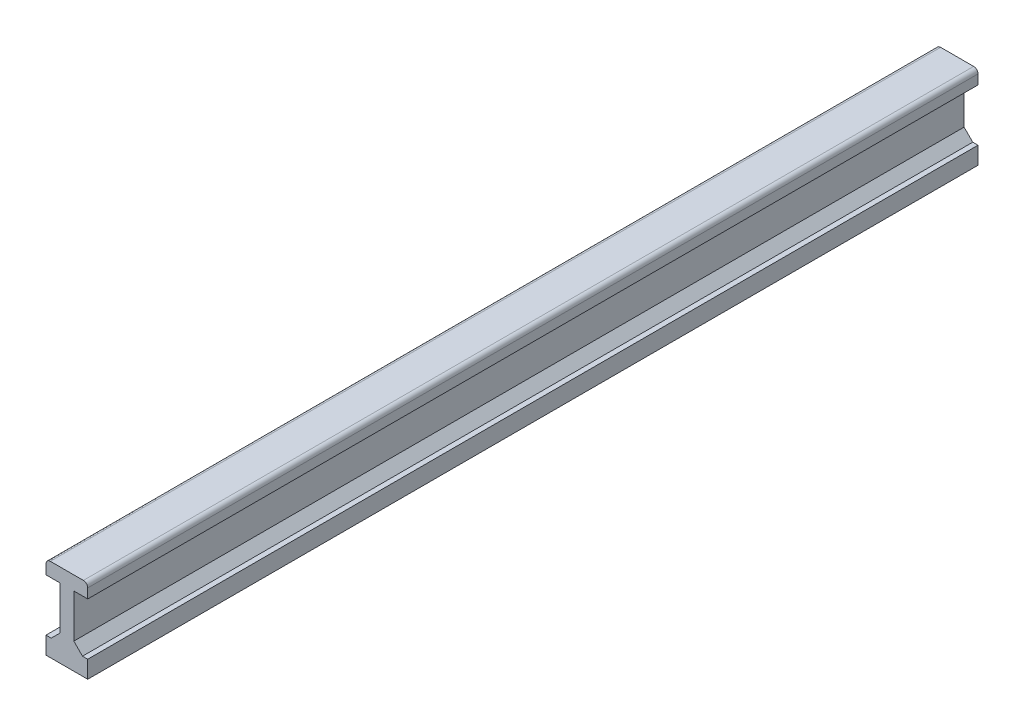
ISO-10303-21;
HEADER;
FILE_DESCRIPTION(('STEP AP214'),'2;1');
FILE_NAME('part.step','',(''),(''),'','','');
FILE_SCHEMA(('AUTOMOTIVE_DESIGN { 1 0 10303 214 1 1 1 1 }'));
ENDSEC;
DATA;
#1=APPLICATION_CONTEXT('core data for automotive mechanical design processes');
#2=APPLICATION_PROTOCOL_DEFINITION('international standard','automotive_design',2000,#1);
#3=PRODUCT_CONTEXT('',#1,'mechanical');
#4=PRODUCT('Part','Part','',(#3));
#5=PRODUCT_RELATED_PRODUCT_CATEGORY('part','',(#4));
#6=PRODUCT_DEFINITION_FORMATION('','',#4);
#7=PRODUCT_DEFINITION_CONTEXT('part definition',#1,'design');
#8=PRODUCT_DEFINITION('design','',#6,#7);
#9=PRODUCT_DEFINITION_SHAPE('','',#8);
#10=(LENGTH_UNIT() NAMED_UNIT(*) SI_UNIT(.MILLI.,.METRE.));
#11=(NAMED_UNIT(*) PLANE_ANGLE_UNIT() SI_UNIT($,.RADIAN.));
#12=(NAMED_UNIT(*) SI_UNIT($,.STERADIAN.) SOLID_ANGLE_UNIT());
#13=UNCERTAINTY_MEASURE_WITH_UNIT(LENGTH_MEASURE(1.E-05),#10,'distance_accuracy_value','');
#14=(GEOMETRIC_REPRESENTATION_CONTEXT(3) GLOBAL_UNCERTAINTY_ASSIGNED_CONTEXT((#13)) GLOBAL_UNIT_ASSIGNED_CONTEXT((#10,
#11,#12)) REPRESENTATION_CONTEXT('',''));
#15=CARTESIAN_POINT('',(0.,0.,0.));
#16=DIRECTION('',(0.,0.,1.));
#17=DIRECTION('',(1.,0.,0.));
#18=AXIS2_PLACEMENT_3D('',#15,#16,#17);
#19=CARTESIAN_POINT('',(-711.2,127.,812.8));
#20=DIRECTION('',(0.,1.,0.));
#21=DIRECTION('',(0.,0.,1.));
#22=AXIS2_PLACEMENT_3D('',#19,#20,#21);
#23=PLANE('',#22);
#24=DIRECTION('',(1.,0.,0.));
#25=VECTOR('',#24,1.);
#26=CARTESIAN_POINT('',(-711.2,127.,-812.8));
#27=LINE('',#26,#25);
#28=CARTESIAN_POINT('',(-736.6,127.,-812.8));
#29=VERTEX_POINT('',#28);
#30=CARTESIAN_POINT('',(-711.2,127.,-812.8));
#31=VERTEX_POINT('',#30);
#32=EDGE_CURVE('E169',#29,#31,#27,.T.);
#33=ORIENTED_EDGE('',*,*,#32,.T.);
#34=DIRECTION('',(0.,0.,-1.));
#35=VECTOR('',#34,1.);
#36=CARTESIAN_POINT('',(-711.2,127.,812.8));
#37=LINE('',#36,#35);
#38=CARTESIAN_POINT('',(-711.2,127.,812.8));
#39=VERTEX_POINT('',#38);
#40=EDGE_CURVE('E150',#39,#31,#37,.T.);
#41=ORIENTED_EDGE('',*,*,#40,.F.);
#42=DIRECTION('',(1.,0.,0.));
#43=VECTOR('',#42,1.);
#44=CARTESIAN_POINT('',(-711.2,127.,812.8));
#45=LINE('',#44,#43);
#46=CARTESIAN_POINT('',(-736.6,127.,812.8));
#47=VERTEX_POINT('',#46);
#48=EDGE_CURVE('E157',#47,#39,#45,.T.);
#49=ORIENTED_EDGE('',*,*,#48,.F.);
#50=DIRECTION('',(0.,0.,-1.));
#51=VECTOR('',#50,1.);
#52=CARTESIAN_POINT('',(-736.6,127.,812.8));
#53=LINE('',#52,#51);
#54=EDGE_CURVE('E216',#47,#29,#53,.T.);
#55=ORIENTED_EDGE('',*,*,#54,.T.);
#56=EDGE_LOOP('',(#33,#41,#49,#55));
#57=FACE_BOUND('',#56,.T.);
#58=ADVANCED_FACE('F32',(#57),#23,.F.);
#59=CARTESIAN_POINT('',(-711.2,127.,812.8));
#60=DIRECTION('',(-1.,0.,0.));
#61=DIRECTION('',(0.,0.,1.));
#62=AXIS2_PLACEMENT_3D('',#59,#60,#61);
#63=PLANE('',#62);
#64=DIRECTION('',(0.,1.,0.));
#65=VECTOR('',#64,1.);
#66=CARTESIAN_POINT('',(-711.2,127.,-812.8));
#67=LINE('',#66,#65);
#68=CARTESIAN_POINT('',(-711.2,144.4752,-812.8));
#69=VERTEX_POINT('',#68);
#70=EDGE_CURVE('E284',#31,#69,#67,.T.);
#71=ORIENTED_EDGE('',*,*,#70,.T.);
#72=DIRECTION('',(0.,0.,-1.));
#73=VECTOR('',#72,1.);
#74=CARTESIAN_POINT('',(-711.2,144.4752,812.8));
#75=LINE('',#74,#73);
#76=CARTESIAN_POINT('',(-711.2,144.4752,812.8));
#77=VERTEX_POINT('',#76);
#78=EDGE_CURVE('E153',#69,#77,#75,.F.);
#79=ORIENTED_EDGE('',*,*,#78,.T.);
#80=DIRECTION('',(0.,1.,0.));
#81=VECTOR('',#80,1.);
#82=CARTESIAN_POINT('',(-711.2,127.,812.8));
#83=LINE('',#82,#81);
#84=EDGE_CURVE('E145',#39,#77,#83,.T.);
#85=ORIENTED_EDGE('',*,*,#84,.F.);
#86=ORIENTED_EDGE('',*,*,#40,.T.);
#87=EDGE_LOOP('',(#71,#79,#85,#86));
#88=FACE_BOUND('',#87,.T.);
#89=ADVANCED_FACE('F148',(#88),#63,.F.);
#90=CARTESIAN_POINT('',(-711.2,152.4,812.8));
#91=DIRECTION('',(0.,-1.,0.));
#92=DIRECTION('',(0.,0.,-1.));
#93=AXIS2_PLACEMENT_3D('',#90,#91,#92);
#94=PLANE('',#93);
#95=DIRECTION('',(-1.,0.,0.));
#96=VECTOR('',#95,1.);
#97=CARTESIAN_POINT('',(-711.2,152.4,812.8));
#98=LINE('',#97,#96);
#99=CARTESIAN_POINT('',(-719.1248,152.4,812.8));
#100=VERTEX_POINT('',#99);
#101=CARTESIAN_POINT('',(-779.4752,152.4,812.8));
#102=VERTEX_POINT('',#101);
#103=EDGE_CURVE('E156',#100,#102,#98,.T.);
#104=ORIENTED_EDGE('',*,*,#103,.F.);
#105=DIRECTION('',(0.,0.,-1.));
#106=VECTOR('',#105,1.);
#107=CARTESIAN_POINT('',(-719.1248,152.4,812.8));
#108=LINE('',#107,#106);
#109=CARTESIAN_POINT('',(-719.1248,152.4,-812.8));
#110=VERTEX_POINT('',#109);
#111=EDGE_CURVE('E173',#100,#110,#108,.T.);
#112=ORIENTED_EDGE('',*,*,#111,.T.);
#113=DIRECTION('',(-1.,0.,0.));
#114=VECTOR('',#113,1.);
#115=CARTESIAN_POINT('',(-711.2,152.4,-812.8));
#116=LINE('',#115,#114);
#117=CARTESIAN_POINT('',(-779.4752,152.4,-812.8));
#118=VERTEX_POINT('',#117);
#119=EDGE_CURVE('E286',#110,#118,#116,.T.);
#120=ORIENTED_EDGE('',*,*,#119,.T.);
#121=DIRECTION('',(0.,0.,-1.));
#122=VECTOR('',#121,1.);
#123=CARTESIAN_POINT('',(-779.4752,152.4,812.8));
#124=LINE('',#123,#122);
#125=EDGE_CURVE('E170',#118,#102,#124,.F.);
#126=ORIENTED_EDGE('',*,*,#125,.T.);
#127=EDGE_LOOP('',(#104,#112,#120,#126));
#128=FACE_BOUND('',#127,.T.);
#129=ADVANCED_FACE('F322',(#128),#94,.F.);
#130=CARTESIAN_POINT('',(-787.4,152.4,812.8));
#131=DIRECTION('',(1.,0.,0.));
#132=DIRECTION('',(0.,0.,-1.));
#133=AXIS2_PLACEMENT_3D('',#130,#131,#132);
#134=PLANE('',#133);
#135=DIRECTION('',(0.,-1.,0.));
#136=VECTOR('',#135,1.);
#137=CARTESIAN_POINT('',(-787.4,152.4,812.8));
#138=LINE('',#137,#136);
#139=CARTESIAN_POINT('',(-787.4,144.4752,812.8));
#140=VERTEX_POINT('',#139);
#141=CARTESIAN_POINT('',(-787.4,127.,812.8));
#142=VERTEX_POINT('',#141);
#143=EDGE_CURVE('E295',#140,#142,#138,.T.);
#144=ORIENTED_EDGE('',*,*,#143,.F.);
#145=DIRECTION('',(0.,0.,-1.));
#146=VECTOR('',#145,1.);
#147=CARTESIAN_POINT('',(-787.4,144.4752,812.8));
#148=LINE('',#147,#146);
#149=CARTESIAN_POINT('',(-787.4,144.4752,-812.8));
#150=VERTEX_POINT('',#149);
#151=EDGE_CURVE('E191',#140,#150,#148,.T.);
#152=ORIENTED_EDGE('',*,*,#151,.T.);
#153=DIRECTION('',(0.,-1.,0.));
#154=VECTOR('',#153,1.);
#155=CARTESIAN_POINT('',(-787.4,152.4,-812.8));
#156=LINE('',#155,#154);
#157=CARTESIAN_POINT('',(-787.4,127.,-812.8));
#158=VERTEX_POINT('',#157);
#159=EDGE_CURVE('E261',#150,#158,#156,.T.);
#160=ORIENTED_EDGE('',*,*,#159,.T.);
#161=DIRECTION('',(0.,0.,-1.));
#162=VECTOR('',#161,1.);
#163=CARTESIAN_POINT('',(-787.4,127.,812.8));
#164=LINE('',#163,#162);
#165=EDGE_CURVE('E171',#142,#158,#164,.T.);
#166=ORIENTED_EDGE('',*,*,#165,.F.);
#167=EDGE_LOOP('',(#144,#152,#160,#166));
#168=FACE_BOUND('',#167,.T.);
#169=ADVANCED_FACE('F291',(#168),#134,.F.);
#170=CARTESIAN_POINT('',(-787.4,127.,812.8));
#171=DIRECTION('',(0.,1.,0.));
#172=DIRECTION('',(0.,0.,1.));
#173=AXIS2_PLACEMENT_3D('',#170,#171,#172);
#174=PLANE('',#173);
#175=DIRECTION('',(1.,0.,0.));
#176=VECTOR('',#175,1.);
#177=CARTESIAN_POINT('',(-787.4,127.,-812.8));
#178=LINE('',#177,#176);
#179=CARTESIAN_POINT('',(-762.,127.,-812.8));
#180=VERTEX_POINT('',#179);
#181=EDGE_CURVE('E256',#158,#180,#178,.T.);
#182=ORIENTED_EDGE('',*,*,#181,.T.);
#183=DIRECTION('',(0.,0.,-1.));
#184=VECTOR('',#183,1.);
#185=CARTESIAN_POINT('',(-762.,127.,812.8));
#186=LINE('',#185,#184);
#187=CARTESIAN_POINT('',(-762.,127.,812.8));
#188=VERTEX_POINT('',#187);
#189=EDGE_CURVE('E176',#188,#180,#186,.T.);
#190=ORIENTED_EDGE('',*,*,#189,.F.);
#191=DIRECTION('',(1.,0.,0.));
#192=VECTOR('',#191,1.);
#193=CARTESIAN_POINT('',(-787.4,127.,812.8));
#194=LINE('',#193,#192);
#195=EDGE_CURVE('E294',#142,#188,#194,.T.);
#196=ORIENTED_EDGE('',*,*,#195,.F.);
#197=ORIENTED_EDGE('',*,*,#165,.T.);
#198=EDGE_LOOP('',(#182,#190,#196,#197));
#199=FACE_BOUND('',#198,.T.);
#200=ADVANCED_FACE('F293',(#199),#174,.F.);
#201=CARTESIAN_POINT('',(-762.,127.,812.8));
#202=DIRECTION('',(1.,0.,0.));
#203=DIRECTION('',(0.,0.,-1.));
#204=AXIS2_PLACEMENT_3D('',#201,#202,#203);
#205=PLANE('',#204);
#206=DIRECTION('',(0.,-1.,0.));
#207=VECTOR('',#206,1.);
#208=CARTESIAN_POINT('',(-762.,127.,-812.8));
#209=LINE('',#208,#207);
#210=CARTESIAN_POINT('',(-762.,47.6250000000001,-812.8));
#211=VERTEX_POINT('',#210);
#212=EDGE_CURVE('E250',#180,#211,#209,.T.);
#213=ORIENTED_EDGE('',*,*,#212,.T.);
#214=DIRECTION('',(0.,0.,1.));
#215=VECTOR('',#214,1.);
#216=CARTESIAN_POINT('',(-762.,47.6250000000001,812.8));
#217=LINE('',#216,#215);
#218=CARTESIAN_POINT('',(-762.,47.6250000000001,812.8));
#219=VERTEX_POINT('',#218);
#220=EDGE_CURVE('E47',#211,#219,#217,.T.);
#221=ORIENTED_EDGE('',*,*,#220,.T.);
#222=DIRECTION('',(0.,-1.,0.));
#223=VECTOR('',#222,1.);
#224=CARTESIAN_POINT('',(-762.,127.,812.8));
#225=LINE('',#224,#223);
#226=EDGE_CURVE('E251',#188,#219,#225,.T.);
#227=ORIENTED_EDGE('',*,*,#226,.F.);
#228=ORIENTED_EDGE('',*,*,#189,.T.);
#229=EDGE_LOOP('',(#213,#221,#227,#228));
#230=FACE_BOUND('',#229,.T.);
#231=ADVANCED_FACE('F249',(#230),#205,.F.);
#232=CARTESIAN_POINT('',(-762.,31.75,812.8));
#233=DIRECTION('',(0.,-1.,0.));
#234=DIRECTION('',(0.,0.,-1.));
#235=AXIS2_PLACEMENT_3D('',#232,#233,#234);
#236=PLANE('',#235);
#237=DIRECTION('',(-1.,0.,0.));
#238=VECTOR('',#237,1.);
#239=CARTESIAN_POINT('',(-762.,31.75,812.8));
#240=LINE('',#239,#238);
#241=CARTESIAN_POINT('',(-777.875,31.75,812.8));
#242=VERTEX_POINT('',#241);
#243=CARTESIAN_POINT('',(-787.4,31.75,812.8));
#244=VERTEX_POINT('',#243);
#245=EDGE_CURVE('E297',#242,#244,#240,.T.);
#246=ORIENTED_EDGE('',*,*,#245,.F.);
#247=DIRECTION('',(0.,0.,-1.));
#248=VECTOR('',#247,1.);
#249=CARTESIAN_POINT('',(-777.875,31.75,-812.8));
#250=LINE('',#249,#248);
#251=CARTESIAN_POINT('',(-777.875,31.75,-812.8));
#252=VERTEX_POINT('',#251);
#253=EDGE_CURVE('E199',#242,#252,#250,.T.);
#254=ORIENTED_EDGE('',*,*,#253,.T.);
#255=DIRECTION('',(-1.,0.,0.));
#256=VECTOR('',#255,1.);
#257=CARTESIAN_POINT('',(-762.,31.75,-812.8));
#258=LINE('',#257,#256);
#259=CARTESIAN_POINT('',(-787.4,31.75,-812.8));
#260=VERTEX_POINT('',#259);
#261=EDGE_CURVE('E257',#252,#260,#258,.T.);
#262=ORIENTED_EDGE('',*,*,#261,.T.);
#263=DIRECTION('',(0.,0.,-1.));
#264=VECTOR('',#263,1.);
#265=CARTESIAN_POINT('',(-787.4,31.75,812.8));
#266=LINE('',#265,#264);
#267=EDGE_CURVE('E245',#244,#260,#266,.T.);
#268=ORIENTED_EDGE('',*,*,#267,.F.);
#269=EDGE_LOOP('',(#246,#254,#262,#268));
#270=FACE_BOUND('',#269,.T.);
#271=ADVANCED_FACE('F308',(#270),#236,.F.);
#272=CARTESIAN_POINT('',(-787.4,31.75,812.8));
#273=DIRECTION('',(1.,0.,0.));
#274=DIRECTION('',(0.,0.,-1.));
#275=AXIS2_PLACEMENT_3D('',#272,#273,#274);
#276=PLANE('',#275);
#277=DIRECTION('',(0.,-1.,0.));
#278=VECTOR('',#277,1.);
#279=CARTESIAN_POINT('',(-787.4,31.75,-812.8));
#280=LINE('',#279,#278);
#281=CARTESIAN_POINT('',(-787.4,0.,-812.8));
#282=VERTEX_POINT('',#281);
#283=EDGE_CURVE('E259',#260,#282,#280,.T.);
#284=ORIENTED_EDGE('',*,*,#283,.T.);
#285=DIRECTION('',(0.,0.,-1.));
#286=VECTOR('',#285,1.);
#287=CARTESIAN_POINT('',(-787.4,0.,812.8));
#288=LINE('',#287,#286);
#289=CARTESIAN_POINT('',(-787.4,0.,812.8));
#290=VERTEX_POINT('',#289);
#291=EDGE_CURVE('E242',#290,#282,#288,.T.);
#292=ORIENTED_EDGE('',*,*,#291,.F.);
#293=DIRECTION('',(0.,-1.,0.));
#294=VECTOR('',#293,1.);
#295=CARTESIAN_POINT('',(-787.4,31.75,812.8));
#296=LINE('',#295,#294);
#297=EDGE_CURVE('E279',#244,#290,#296,.T.);
#298=ORIENTED_EDGE('',*,*,#297,.F.);
#299=ORIENTED_EDGE('',*,*,#267,.T.);
#300=EDGE_LOOP('',(#284,#292,#298,#299));
#301=FACE_BOUND('',#300,.T.);
#302=ADVANCED_FACE('F306',(#301),#276,.F.);
#303=CARTESIAN_POINT('',(-787.4,0.,812.8));
#304=DIRECTION('',(0.,1.,0.));
#305=DIRECTION('',(-1.,0.,0.));
#306=AXIS2_PLACEMENT_3D('',#303,#304,#305);
#307=PLANE('',#306);
#308=DIRECTION('',(1.,0.,0.));
#309=VECTOR('',#308,1.);
#310=CARTESIAN_POINT('',(-787.4,0.,-812.8));
#311=LINE('',#310,#309);
#312=CARTESIAN_POINT('',(-711.2,0.,-812.8));
#313=VERTEX_POINT('',#312);
#314=EDGE_CURVE('E233',#282,#313,#311,.T.);
#315=ORIENTED_EDGE('',*,*,#314,.T.);
#316=DIRECTION('',(0.,0.,-1.));
#317=VECTOR('',#316,1.);
#318=CARTESIAN_POINT('',(-711.2,0.,812.8));
#319=LINE('',#318,#317);
#320=CARTESIAN_POINT('',(-711.2,0.,812.8));
#321=VERTEX_POINT('',#320);
#322=EDGE_CURVE('E239',#321,#313,#319,.T.);
#323=ORIENTED_EDGE('',*,*,#322,.F.);
#324=DIRECTION('',(1.,0.,0.));
#325=VECTOR('',#324,1.);
#326=CARTESIAN_POINT('',(-787.4,0.,812.8));
#327=LINE('',#326,#325);
#328=EDGE_CURVE('E276',#290,#321,#327,.T.);
#329=ORIENTED_EDGE('',*,*,#328,.F.);
#330=ORIENTED_EDGE('',*,*,#291,.T.);
#331=EDGE_LOOP('',(#315,#323,#329,#330));
#332=FACE_BOUND('',#331,.T.);
#333=ADVANCED_FACE('F268',(#332),#307,.F.);
#334=CARTESIAN_POINT('',(-711.2,0.,812.8));
#335=DIRECTION('',(-1.,0.,0.));
#336=DIRECTION('',(0.,0.,1.));
#337=AXIS2_PLACEMENT_3D('',#334,#335,#336);
#338=PLANE('',#337);
#339=DIRECTION('',(0.,1.,0.));
#340=VECTOR('',#339,1.);
#341=CARTESIAN_POINT('',(-711.2,0.,-812.8));
#342=LINE('',#341,#340);
#343=CARTESIAN_POINT('',(-711.2,31.75,-812.8));
#344=VERTEX_POINT('',#343);
#345=EDGE_CURVE('E230',#313,#344,#342,.T.);
#346=ORIENTED_EDGE('',*,*,#345,.T.);
#347=DIRECTION('',(0.,0.,-1.));
#348=VECTOR('',#347,1.);
#349=CARTESIAN_POINT('',(-711.2,31.75,812.8));
#350=LINE('',#349,#348);
#351=CARTESIAN_POINT('',(-711.2,31.75,812.8));
#352=VERTEX_POINT('',#351);
#353=EDGE_CURVE('E229',#352,#344,#350,.T.);
#354=ORIENTED_EDGE('',*,*,#353,.F.);
#355=DIRECTION('',(0.,1.,0.));
#356=VECTOR('',#355,1.);
#357=CARTESIAN_POINT('',(-711.2,0.,812.8));
#358=LINE('',#357,#356);
#359=EDGE_CURVE('E275',#321,#352,#358,.T.);
#360=ORIENTED_EDGE('',*,*,#359,.F.);
#361=ORIENTED_EDGE('',*,*,#322,.T.);
#362=EDGE_LOOP('',(#346,#354,#360,#361));
#363=FACE_BOUND('',#362,.T.);
#364=ADVANCED_FACE('F274',(#363),#338,.F.);
#365=CARTESIAN_POINT('',(-736.6,31.75,812.8));
#366=DIRECTION('',(0.,-1.,0.));
#367=DIRECTION('',(0.,0.,-1.));
#368=AXIS2_PLACEMENT_3D('',#365,#366,#367);
#369=PLANE('',#368);
#370=DIRECTION('',(-1.,0.,0.));
#371=VECTOR('',#370,1.);
#372=CARTESIAN_POINT('',(-736.6,31.75,-812.8));
#373=LINE('',#372,#371);
#374=CARTESIAN_POINT('',(-720.725,31.75,-812.8));
#375=VERTEX_POINT('',#374);
#376=EDGE_CURVE('E224',#344,#375,#373,.T.);
#377=ORIENTED_EDGE('',*,*,#376,.T.);
#378=DIRECTION('',(0.,0.,1.));
#379=VECTOR('',#378,1.);
#380=CARTESIAN_POINT('',(-720.725,31.75,812.8));
#381=LINE('',#380,#379);
#382=CARTESIAN_POINT('',(-720.725,31.75,812.8));
#383=VERTEX_POINT('',#382);
#384=EDGE_CURVE('E197',#375,#383,#381,.T.);
#385=ORIENTED_EDGE('',*,*,#384,.T.);
#386=DIRECTION('',(-1.,0.,0.));
#387=VECTOR('',#386,1.);
#388=CARTESIAN_POINT('',(-736.6,31.75,812.8));
#389=LINE('',#388,#387);
#390=EDGE_CURVE('E209',#352,#383,#389,.T.);
#391=ORIENTED_EDGE('',*,*,#390,.F.);
#392=ORIENTED_EDGE('',*,*,#353,.T.);
#393=EDGE_LOOP('',(#377,#385,#391,#392));
#394=FACE_BOUND('',#393,.T.);
#395=ADVANCED_FACE('F227',(#394),#369,.F.);
#396=CARTESIAN_POINT('',(-736.6,127.,812.8));
#397=DIRECTION('',(-1.,0.,0.));
#398=DIRECTION('',(0.,0.,1.));
#399=AXIS2_PLACEMENT_3D('',#396,#397,#398);
#400=PLANE('',#399);
#401=DIRECTION('',(0.,1.,0.));
#402=VECTOR('',#401,1.);
#403=CARTESIAN_POINT('',(-736.6,127.,812.8));
#404=LINE('',#403,#402);
#405=CARTESIAN_POINT('',(-736.6,47.6250000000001,812.8));
#406=VERTEX_POINT('',#405);
#407=EDGE_CURVE('E162',#406,#47,#404,.T.);
#408=ORIENTED_EDGE('',*,*,#407,.F.);
#409=DIRECTION('',(0.,0.,-1.));
#410=VECTOR('',#409,1.);
#411=CARTESIAN_POINT('',(-736.6,47.6250000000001,-812.8));
#412=LINE('',#411,#410);
#413=CARTESIAN_POINT('',(-736.6,47.6250000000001,-812.8));
#414=VERTEX_POINT('',#413);
#415=EDGE_CURVE('E194',#406,#414,#412,.T.);
#416=ORIENTED_EDGE('',*,*,#415,.T.);
#417=DIRECTION('',(0.,1.,0.));
#418=VECTOR('',#417,1.);
#419=CARTESIAN_POINT('',(-736.6,127.,-812.8));
#420=LINE('',#419,#418);
#421=EDGE_CURVE('E166',#414,#29,#420,.T.);
#422=ORIENTED_EDGE('',*,*,#421,.T.);
#423=ORIENTED_EDGE('',*,*,#54,.F.);
#424=EDGE_LOOP('',(#408,#416,#422,#423));
#425=FACE_BOUND('',#424,.T.);
#426=ADVANCED_FACE('F214',(#425),#400,.F.);
#427=CARTESIAN_POINT('',(0.,0.,812.8));
#428=DIRECTION('',(0.,0.,1.));
#429=DIRECTION('',(1.,0.,0.));
#430=AXIS2_PLACEMENT_3D('',#427,#428,#429);
#431=PLANE('',#430);
#432=ORIENTED_EDGE('',*,*,#84,.T.);
#433=CARTESIAN_POINT('',(-719.1248,144.4752,812.8));
#434=DIRECTION('',(0.,0.,1.));
#435=DIRECTION('',(1.,0.,0.));
#436=AXIS2_PLACEMENT_3D('',#433,#434,#435);
#437=CIRCLE('',#436,7.9248);
#438=EDGE_CURVE('E189',#77,#100,#437,.T.);
#439=ORIENTED_EDGE('',*,*,#438,.T.);
#440=ORIENTED_EDGE('',*,*,#103,.T.);
#441=CARTESIAN_POINT('',(-779.4752,144.4752,812.8));
#442=DIRECTION('',(0.,0.,1.));
#443=DIRECTION('',(1.,0.,0.));
#444=AXIS2_PLACEMENT_3D('',#441,#442,#443);
#445=CIRCLE('',#444,7.9248);
#446=EDGE_CURVE('E187',#102,#140,#445,.T.);
#447=ORIENTED_EDGE('',*,*,#446,.T.);
#448=ORIENTED_EDGE('',*,*,#143,.T.);
#449=ORIENTED_EDGE('',*,*,#195,.T.);
#450=ORIENTED_EDGE('',*,*,#226,.T.);
#451=DIRECTION('',(0.707106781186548,0.707106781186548,0.));
#452=VECTOR('',#451,1.);
#453=CARTESIAN_POINT('',(-777.875,31.75,812.8));
#454=LINE('',#453,#452);
#455=EDGE_CURVE('E11',#219,#242,#454,.F.);
#456=ORIENTED_EDGE('',*,*,#455,.T.);
#457=ORIENTED_EDGE('',*,*,#245,.T.);
#458=ORIENTED_EDGE('',*,*,#297,.T.);
#459=ORIENTED_EDGE('',*,*,#328,.T.);
#460=ORIENTED_EDGE('',*,*,#359,.T.);
#461=ORIENTED_EDGE('',*,*,#390,.T.);
#462=DIRECTION('',(0.707106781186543,-0.707106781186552,0.));
#463=VECTOR('',#462,1.);
#464=CARTESIAN_POINT('',(-736.6,47.6250000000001,812.8));
#465=LINE('',#464,#463);
#466=EDGE_CURVE('E205',#383,#406,#465,.F.);
#467=ORIENTED_EDGE('',*,*,#466,.T.);
#468=ORIENTED_EDGE('',*,*,#407,.T.);
#469=ORIENTED_EDGE('',*,*,#48,.T.);
#470=EDGE_LOOP('',(#432,#439,#440,#447,#448,#449,#450,#456,#457,#458,#459,#460,#461,#467,#468,#469));
#471=FACE_BOUND('',#470,.T.);
#472=ADVANCED_FACE('F160',(#471),#431,.T.);
#473=CARTESIAN_POINT('',(0.,0.,-812.8));
#474=DIRECTION('',(0.,0.,1.));
#475=DIRECTION('',(1.,0.,0.));
#476=AXIS2_PLACEMENT_3D('',#473,#474,#475);
#477=PLANE('',#476);
#478=ORIENTED_EDGE('',*,*,#119,.F.);
#479=CARTESIAN_POINT('',(-719.1248,144.4752,-812.8));
#480=DIRECTION('',(0.,0.,1.));
#481=DIRECTION('',(1.,0.,0.));
#482=AXIS2_PLACEMENT_3D('',#479,#480,#481);
#483=CIRCLE('',#482,7.9248);
#484=EDGE_CURVE('E184',#110,#69,#483,.F.);
#485=ORIENTED_EDGE('',*,*,#484,.T.);
#486=ORIENTED_EDGE('',*,*,#70,.F.);
#487=ORIENTED_EDGE('',*,*,#32,.F.);
#488=ORIENTED_EDGE('',*,*,#421,.F.);
#489=DIRECTION('',(-0.707106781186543,0.707106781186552,0.));
#490=VECTOR('',#489,1.);
#491=CARTESIAN_POINT('',(-344.487500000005,-344.4875,-812.8));
#492=LINE('',#491,#490);
#493=EDGE_CURVE('E203',#414,#375,#492,.F.);
#494=ORIENTED_EDGE('',*,*,#493,.T.);
#495=ORIENTED_EDGE('',*,*,#376,.F.);
#496=ORIENTED_EDGE('',*,*,#345,.F.);
#497=ORIENTED_EDGE('',*,*,#314,.F.);
#498=ORIENTED_EDGE('',*,*,#283,.F.);
#499=ORIENTED_EDGE('',*,*,#261,.F.);
#500=DIRECTION('',(-0.707106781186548,-0.707106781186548,0.));
#501=VECTOR('',#500,1.);
#502=CARTESIAN_POINT('',(-404.8125,404.8125,-812.8));
#503=LINE('',#502,#501);
#504=EDGE_CURVE('E40',#252,#211,#503,.F.);
#505=ORIENTED_EDGE('',*,*,#504,.T.);
#506=ORIENTED_EDGE('',*,*,#212,.F.);
#507=ORIENTED_EDGE('',*,*,#181,.F.);
#508=ORIENTED_EDGE('',*,*,#159,.F.);
#509=CARTESIAN_POINT('',(-779.4752,144.4752,-812.8));
#510=DIRECTION('',(0.,0.,1.));
#511=DIRECTION('',(1.,0.,0.));
#512=AXIS2_PLACEMENT_3D('',#509,#510,#511);
#513=CIRCLE('',#512,7.9248);
#514=EDGE_CURVE('E182',#150,#118,#513,.F.);
#515=ORIENTED_EDGE('',*,*,#514,.T.);
#516=EDGE_LOOP('',(#478,#485,#486,#487,#488,#494,#495,#496,#497,#498,#499,#505,#506,#507,#508,#515));
#517=FACE_BOUND('',#516,.T.);
#518=ADVANCED_FACE('F222',(#517),#477,.F.);
#519=CARTESIAN_POINT('',(-719.1248,144.4752,812.8));
#520=DIRECTION('',(0.,0.,-1.));
#521=DIRECTION('',(-1.,0.,0.));
#522=AXIS2_PLACEMENT_3D('',#519,#520,#521);
#523=CYLINDRICAL_SURFACE('',#522,7.9248);
#524=ORIENTED_EDGE('',*,*,#438,.F.);
#525=ORIENTED_EDGE('',*,*,#78,.F.);
#526=ORIENTED_EDGE('',*,*,#484,.F.);
#527=ORIENTED_EDGE('',*,*,#111,.F.);
#528=EDGE_LOOP('',(#524,#525,#526,#527));
#529=FACE_BOUND('',#528,.T.);
#530=ADVANCED_FACE('F326',(#529),#523,.T.);
#531=CARTESIAN_POINT('',(-779.4752,144.4752,812.8));
#532=DIRECTION('',(0.,0.,-1.));
#533=DIRECTION('',(-1.,0.,0.));
#534=AXIS2_PLACEMENT_3D('',#531,#532,#533);
#535=CYLINDRICAL_SURFACE('',#534,7.9248);
#536=ORIENTED_EDGE('',*,*,#446,.F.);
#537=ORIENTED_EDGE('',*,*,#125,.F.);
#538=ORIENTED_EDGE('',*,*,#514,.F.);
#539=ORIENTED_EDGE('',*,*,#151,.F.);
#540=EDGE_LOOP('',(#536,#537,#538,#539));
#541=FACE_BOUND('',#540,.T.);
#542=ADVANCED_FACE('F316',(#541),#535,.T.);
#543=CARTESIAN_POINT('',(-736.6,47.6250000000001,812.8));
#544=DIRECTION('',(0.707106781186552,0.707106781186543,0.));
#545=DIRECTION('',(0.,0.,1.));
#546=AXIS2_PLACEMENT_3D('',#543,#544,#545);
#547=PLANE('',#546);
#548=ORIENTED_EDGE('',*,*,#466,.F.);
#549=ORIENTED_EDGE('',*,*,#384,.F.);
#550=ORIENTED_EDGE('',*,*,#493,.F.);
#551=ORIENTED_EDGE('',*,*,#415,.F.);
#552=EDGE_LOOP('',(#548,#549,#550,#551));
#553=FACE_BOUND('',#552,.T.);
#554=ADVANCED_FACE('F218',(#553),#547,.T.);
#555=CARTESIAN_POINT('',(-777.875,31.75,812.8));
#556=DIRECTION('',(-0.707106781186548,0.707106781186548,0.));
#557=DIRECTION('',(0.,0.,1.));
#558=AXIS2_PLACEMENT_3D('',#555,#556,#557);
#559=PLANE('',#558);
#560=ORIENTED_EDGE('',*,*,#455,.F.);
#561=ORIENTED_EDGE('',*,*,#220,.F.);
#562=ORIENTED_EDGE('',*,*,#504,.F.);
#563=ORIENTED_EDGE('',*,*,#253,.F.);
#564=EDGE_LOOP('',(#560,#561,#562,#563));
#565=FACE_BOUND('',#564,.T.);
#566=ADVANCED_FACE('F34',(#565),#559,.T.);
#567=CLOSED_SHELL('',(#58,#89,#129,#169,#200,#231,#271,#302,#333,#364,#395,#426,#472,#518,#530,
#542,#554,#566));
#568=MANIFOLD_SOLID_BREP('B2',#567);
#569=ADVANCED_BREP_SHAPE_REPRESENTATION('',(#18,#568),#14);
#570=SHAPE_DEFINITION_REPRESENTATION(#9,#569);
ENDSEC;
END-ISO-10303-21;
